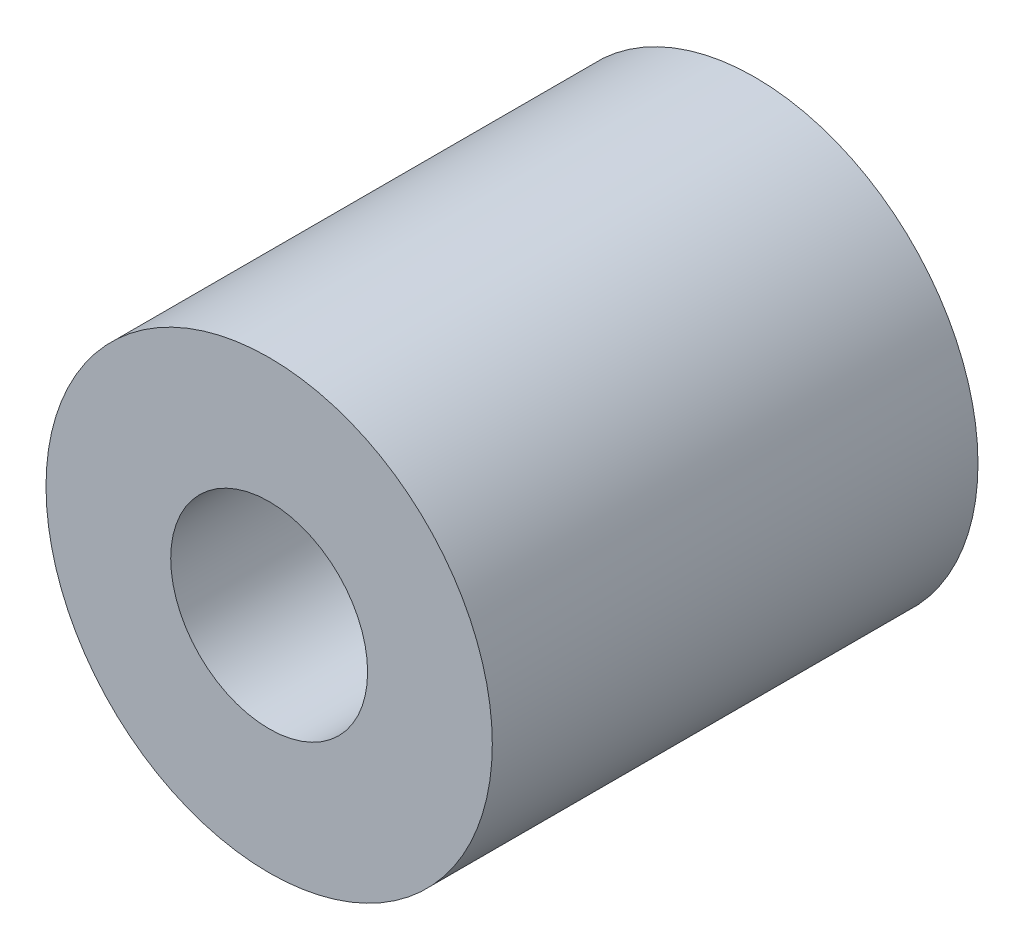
from build123d import *

# Parameters (mm, degrees)
SKETCH1_R          = 8.636
BASE_EXTRUDE_DEPTH = 18.796
SKETCH2_R          = 3.81
CUT_EXTRUDE1_DEPTH = 18.796


with BuildPart() as part:
    # Sketch1 → Base-Extrude (new body)
    with BuildSketch(Plane.XY):
        Circle(SKETCH1_R)
    extrude(amount=BASE_EXTRUDE_DEPTH)

    # Sketch2 → Cut-Extrude1 (cut)
    with BuildSketch(Plane.XY.offset(18.796)):
        Circle(SKETCH2_R)
    extrude(amount=-CUT_EXTRUDE1_DEPTH, mode=Mode.SUBTRACT)


solid = part.part
